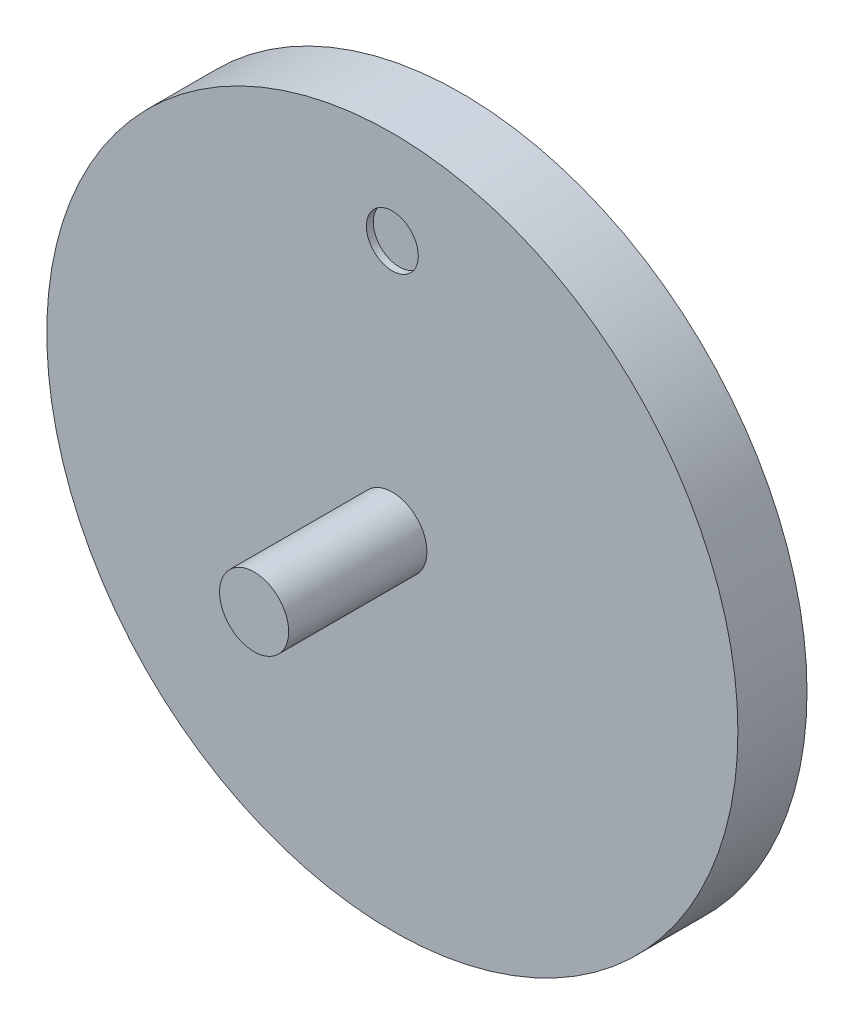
from build123d import *

# Parameters (mm, degrees)
ESQUISSE1_R             = 500
BOSS_EXTRU_1_DEPTH      = 100
ESQUISSE4_R             = 50
BOSS_EXTRU_2_DEPTH      = 200
ESQUISSE5_R             = 37.558974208
ENL_V_MAT_EXTRU_1_DEPTH = 10


with BuildPart() as part:
    # Esquisse1 → Boss.-Extru.1 (new body)
    with BuildSketch(Plane.XY):
        Circle(ESQUISSE1_R)
    extrude(amount=BOSS_EXTRU_1_DEPTH)

    # Esquisse4 → Boss.-Extru.2 (add)
    with BuildSketch(Plane.XY.offset(100)):
        Circle(ESQUISSE4_R)
    extrude(amount=BOSS_EXTRU_2_DEPTH)

    # Esquisse5 → Enl_v. mat.-Extru.1 (cut)
    with BuildSketch(Plane.XY.offset(100)):
        with Locations((0, 364.679377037)):
            Circle(ESQUISSE5_R)
    extrude(amount=-ENL_V_MAT_EXTRU_1_DEPTH, mode=Mode.SUBTRACT)


solid = part.part
